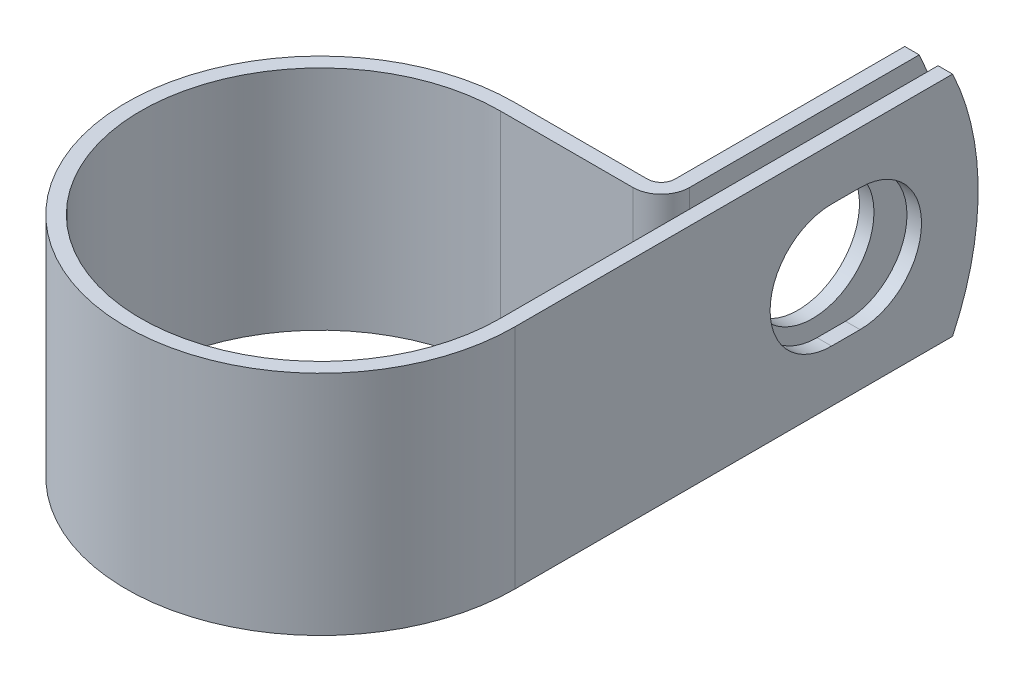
ISO-10303-21;
HEADER;
FILE_DESCRIPTION(('STEP AP214'),'2;1');
FILE_NAME('part.step','',(''),(''),'','','');
FILE_SCHEMA(('AUTOMOTIVE_DESIGN { 1 0 10303 214 1 1 1 1 }'));
ENDSEC;
DATA;
#1=APPLICATION_CONTEXT('core data for automotive mechanical design processes');
#2=APPLICATION_PROTOCOL_DEFINITION('international standard','automotive_design',2000,#1);
#3=PRODUCT_CONTEXT('',#1,'mechanical');
#4=PRODUCT('Part','Part','',(#3));
#5=PRODUCT_RELATED_PRODUCT_CATEGORY('part','',(#4));
#6=PRODUCT_DEFINITION_FORMATION('','',#4);
#7=PRODUCT_DEFINITION_CONTEXT('part definition',#1,'design');
#8=PRODUCT_DEFINITION('design','',#6,#7);
#9=PRODUCT_DEFINITION_SHAPE('','',#8);
#10=(LENGTH_UNIT() NAMED_UNIT(*) SI_UNIT(.MILLI.,.METRE.));
#11=(NAMED_UNIT(*) PLANE_ANGLE_UNIT() SI_UNIT($,.RADIAN.));
#12=(NAMED_UNIT(*) SI_UNIT($,.STERADIAN.) SOLID_ANGLE_UNIT());
#13=UNCERTAINTY_MEASURE_WITH_UNIT(LENGTH_MEASURE(1.E-05),#10,'distance_accuracy_value','');
#14=(GEOMETRIC_REPRESENTATION_CONTEXT(3) GLOBAL_UNCERTAINTY_ASSIGNED_CONTEXT((#13)) GLOBAL_UNIT_ASSIGNED_CONTEXT((#10,
#11,#12)) REPRESENTATION_CONTEXT('',''));
#15=CARTESIAN_POINT('',(0.,0.,0.));
#16=DIRECTION('',(0.,0.,1.));
#17=DIRECTION('',(1.,0.,0.));
#18=AXIS2_PLACEMENT_3D('',#15,#16,#17);
#19=CARTESIAN_POINT('',(15.0749,9.525,0.));
#20=DIRECTION('',(-1.,0.,0.));
#21=DIRECTION('',(0.,0.,1.));
#22=AXIS2_PLACEMENT_3D('',#19,#20,#21);
#23=PLANE('',#22);
#24=DIRECTION('',(0.,0.,-1.));
#25=VECTOR('',#24,1.);
#26=CARTESIAN_POINT('',(15.0749,-5.1562,-26.5683999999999));
#27=LINE('',#26,#25);
#28=CARTESIAN_POINT('',(15.0749,-5.1562,-26.5683999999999));
#29=VERTEX_POINT('',#28);
#30=CARTESIAN_POINT('',(15.0749,-5.1562,-28.9560000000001));
#31=VERTEX_POINT('',#30);
#32=EDGE_CURVE('E236',#29,#31,#27,.T.);
#33=ORIENTED_EDGE('',*,*,#32,.T.);
#34=CARTESIAN_POINT('',(15.0749,0.,-28.9559999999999));
#35=DIRECTION('',(-1.,0.,0.));
#36=DIRECTION('',(0.,0.,1.));
#37=AXIS2_PLACEMENT_3D('',#34,#35,#36);
#38=CIRCLE('',#37,5.1562);
#39=CARTESIAN_POINT('',(15.0749,5.1562,-28.9560000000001));
#40=VERTEX_POINT('',#39);
#41=EDGE_CURVE('E257',#31,#40,#38,.F.);
#42=ORIENTED_EDGE('',*,*,#41,.T.);
#43=DIRECTION('',(0.,0.,1.));
#44=VECTOR('',#43,1.);
#45=CARTESIAN_POINT('',(15.0749,5.1562,-26.5683999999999));
#46=LINE('',#45,#44);
#47=CARTESIAN_POINT('',(15.0749,5.1562,-26.5683999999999));
#48=VERTEX_POINT('',#47);
#49=EDGE_CURVE('E253',#40,#48,#46,.T.);
#50=ORIENTED_EDGE('',*,*,#49,.T.);
#51=CARTESIAN_POINT('',(15.0749,0.,-26.5683999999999));
#52=DIRECTION('',(-1.,0.,0.));
#53=DIRECTION('',(0.,0.,1.));
#54=AXIS2_PLACEMENT_3D('',#51,#52,#53);
#55=CIRCLE('',#54,5.1562);
#56=EDGE_CURVE('E248',#48,#29,#55,.F.);
#57=ORIENTED_EDGE('',*,*,#56,.T.);
#58=EDGE_LOOP('',(#33,#42,#50,#57));
#59=FACE_BOUND('',#58,.T.);
#60=CARTESIAN_POINT('',(15.0749,0.,-16.637));
#61=DIRECTION('',(-1.,0.,0.));
#62=DIRECTION('',(0.,0.,1.));
#63=AXIS2_PLACEMENT_3D('',#60,#61,#62);
#64=CIRCLE('',#63,22.225);
#65=CARTESIAN_POINT('',(15.0749,9.525,-36.7174631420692));
#66=VERTEX_POINT('',#65);
#67=CARTESIAN_POINT('',(15.0749,-9.525,-36.7174631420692));
#68=VERTEX_POINT('',#67);
#69=EDGE_CURVE('E75',#66,#68,#64,.T.);
#70=ORIENTED_EDGE('',*,*,#69,.T.);
#71=DIRECTION('',(0.,0.,-1.));
#72=VECTOR('',#71,1.);
#73=CARTESIAN_POINT('',(15.0749,-9.525,0.));
#74=LINE('',#73,#72);
#75=CARTESIAN_POINT('',(15.0749,-9.525,0.));
#76=VERTEX_POINT('',#75);
#77=EDGE_CURVE('E271',#76,#68,#74,.T.);
#78=ORIENTED_EDGE('',*,*,#77,.F.);
#79=DIRECTION('',(0.,-1.,0.));
#80=VECTOR('',#79,1.);
#81=CARTESIAN_POINT('',(15.0749,9.525,0.));
#82=LINE('',#81,#80);
#83=CARTESIAN_POINT('',(15.0749,9.525,0.));
#84=VERTEX_POINT('',#83);
#85=EDGE_CURVE('E218',#84,#76,#82,.T.);
#86=ORIENTED_EDGE('',*,*,#85,.F.);
#87=DIRECTION('',(0.,0.,-1.));
#88=VECTOR('',#87,1.);
#89=CARTESIAN_POINT('',(15.0749,9.525,-15.0749));
#90=LINE('',#89,#88);
#91=EDGE_CURVE('E273',#84,#66,#90,.T.);
#92=ORIENTED_EDGE('',*,*,#91,.T.);
#93=EDGE_LOOP('',(#70,#78,#86,#92));
#94=FACE_BOUND('',#93,.T.);
#95=ADVANCED_FACE('F54',(#59,#94),#23,.T.);
#96=CARTESIAN_POINT('',(13.5001,9.525,-38.862));
#97=DIRECTION('',(1.,0.,0.));
#98=DIRECTION('',(0.,0.,-1.));
#99=AXIS2_PLACEMENT_3D('',#96,#97,#98);
#100=PLANE('',#99);
#101=CARTESIAN_POINT('',(13.5001,0.,-27.7622));
#102=DIRECTION('',(1.,0.,0.));
#103=DIRECTION('',(0.,0.,-1.));
#104=AXIS2_PLACEMENT_3D('',#101,#102,#103);
#105=CIRCLE('',#104,5.1562);
#106=CARTESIAN_POINT('',(13.5001,0.,-32.9184));
#107=VERTEX_POINT('',#106);
#108=EDGE_CURVE('E268',#107,#107,#105,.F.);
#109=ORIENTED_EDGE('',*,*,#108,.T.);
#110=EDGE_LOOP('',(#109));
#111=FACE_BOUND('',#110,.T.);
#112=DIRECTION('',(0.,0.,1.));
#113=VECTOR('',#112,1.);
#114=CARTESIAN_POINT('',(13.5001,-9.525,-38.862));
#115=LINE('',#114,#113);
#116=CARTESIAN_POINT('',(13.5001,-9.525,-36.7174631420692));
#117=VERTEX_POINT('',#116);
#118=CARTESIAN_POINT('',(13.5001,-9.525,-17.45234));
#119=VERTEX_POINT('',#118);
#120=EDGE_CURVE('E184',#117,#119,#115,.T.);
#121=ORIENTED_EDGE('',*,*,#120,.F.);
#122=CARTESIAN_POINT('',(13.5001,0.,-16.637));
#123=DIRECTION('',(1.,0.,0.));
#124=DIRECTION('',(0.,0.,-1.));
#125=AXIS2_PLACEMENT_3D('',#122,#123,#124);
#126=CIRCLE('',#125,22.225);
#127=CARTESIAN_POINT('',(13.5001,9.525,-36.7174631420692));
#128=VERTEX_POINT('',#127);
#129=EDGE_CURVE('E176',#117,#128,#126,.T.);
#130=ORIENTED_EDGE('',*,*,#129,.T.);
#131=DIRECTION('',(0.,0.,1.));
#132=VECTOR('',#131,1.);
#133=CARTESIAN_POINT('',(13.5001,9.525,-38.862));
#134=LINE('',#133,#132);
#135=CARTESIAN_POINT('',(13.5001,9.525,-17.45234));
#136=VERTEX_POINT('',#135);
#137=EDGE_CURVE('E224',#128,#136,#134,.T.);
#138=ORIENTED_EDGE('',*,*,#137,.T.);
#139=DIRECTION('',(0.,-1.,0.));
#140=VECTOR('',#139,1.);
#141=CARTESIAN_POINT('',(13.5001,9.525,-17.45234));
#142=LINE('',#141,#140);
#143=EDGE_CURVE('E211',#136,#119,#142,.T.);
#144=ORIENTED_EDGE('',*,*,#143,.T.);
#145=EDGE_LOOP('',(#121,#130,#138,#144));
#146=FACE_BOUND('',#145,.T.);
#147=ADVANCED_FACE('F226',(#111,#146),#100,.T.);
#148=CARTESIAN_POINT('',(12.2809,9.525,-38.862));
#149=DIRECTION('',(1.,0.,0.));
#150=DIRECTION('',(0.,0.,-1.));
#151=AXIS2_PLACEMENT_3D('',#148,#149,#150);
#152=PLANE('',#151);
#153=CARTESIAN_POINT('',(12.2809,0.,-27.7622));
#154=DIRECTION('',(-1.,0.,0.));
#155=DIRECTION('',(0.,0.,1.));
#156=AXIS2_PLACEMENT_3D('',#153,#154,#155);
#157=CIRCLE('',#156,5.1562);
#158=CARTESIAN_POINT('',(12.2809,0.,-22.606));
#159=VERTEX_POINT('',#158);
#160=EDGE_CURVE('E265',#159,#159,#157,.T.);
#161=ORIENTED_EDGE('',*,*,#160,.F.);
#162=EDGE_LOOP('',(#161));
#163=FACE_BOUND('',#162,.T.);
#164=CARTESIAN_POINT('',(12.2809,0.,-16.637));
#165=DIRECTION('',(-1.,0.,0.));
#166=DIRECTION('',(0.,0.,1.));
#167=AXIS2_PLACEMENT_3D('',#164,#165,#166);
#168=CIRCLE('',#167,22.225);
#169=CARTESIAN_POINT('',(12.2809,9.525,-36.7174631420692));
#170=VERTEX_POINT('',#169);
#171=CARTESIAN_POINT('',(12.2809,-9.525,-36.7174631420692));
#172=VERTEX_POINT('',#171);
#173=EDGE_CURVE('E67',#170,#172,#168,.T.);
#174=ORIENTED_EDGE('',*,*,#173,.T.);
#175=DIRECTION('',(0.,0.,1.));
#176=VECTOR('',#175,1.);
#177=CARTESIAN_POINT('',(12.2809,-9.525,-38.862));
#178=LINE('',#177,#176);
#179=CARTESIAN_POINT('',(12.2809,-9.525,-17.45234));
#180=VERTEX_POINT('',#179);
#181=EDGE_CURVE('E167',#172,#180,#178,.T.);
#182=ORIENTED_EDGE('',*,*,#181,.T.);
#183=DIRECTION('',(0.,-1.,0.));
#184=VECTOR('',#183,1.);
#185=CARTESIAN_POINT('',(12.2809,9.525,-17.45234));
#186=LINE('',#185,#184);
#187=CARTESIAN_POINT('',(12.2809,9.525,-17.45234));
#188=VERTEX_POINT('',#187);
#189=EDGE_CURVE('E209',#188,#180,#186,.T.);
#190=ORIENTED_EDGE('',*,*,#189,.F.);
#191=DIRECTION('',(0.,0.,1.));
#192=VECTOR('',#191,1.);
#193=CARTESIAN_POINT('',(12.2809,9.525,-38.862));
#194=LINE('',#193,#192);
#195=EDGE_CURVE('E169',#170,#188,#194,.T.);
#196=ORIENTED_EDGE('',*,*,#195,.F.);
#197=EDGE_LOOP('',(#174,#182,#190,#196));
#198=FACE_BOUND('',#197,.T.);
#199=ADVANCED_FACE('F164',(#163,#198),#152,.F.);
#200=CARTESIAN_POINT('',(16.2941,9.525,0.));
#201=DIRECTION('',(-1.,0.,0.));
#202=DIRECTION('',(0.,0.,1.));
#203=AXIS2_PLACEMENT_3D('',#200,#201,#202);
#204=PLANE('',#203);
#205=CARTESIAN_POINT('',(16.2941,0.,-28.9559999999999));
#206=DIRECTION('',(1.,0.,0.));
#207=DIRECTION('',(0.,0.,-1.));
#208=AXIS2_PLACEMENT_3D('',#205,#206,#207);
#209=CIRCLE('',#208,5.1562);
#210=CARTESIAN_POINT('',(16.2941,-5.1562,-28.9560000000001));
#211=VERTEX_POINT('',#210);
#212=CARTESIAN_POINT('',(16.2941,5.1562,-28.9560000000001));
#213=VERTEX_POINT('',#212);
#214=EDGE_CURVE('E237',#211,#213,#209,.T.);
#215=ORIENTED_EDGE('',*,*,#214,.F.);
#216=DIRECTION('',(0.,0.,-1.));
#217=VECTOR('',#216,1.);
#218=CARTESIAN_POINT('',(16.2941,-5.1562,-26.5683999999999));
#219=LINE('',#218,#217);
#220=CARTESIAN_POINT('',(16.2941,-5.1562,-26.5683999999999));
#221=VERTEX_POINT('',#220);
#222=EDGE_CURVE('E240',#221,#211,#219,.T.);
#223=ORIENTED_EDGE('',*,*,#222,.F.);
#224=CARTESIAN_POINT('',(16.2941,0.,-26.5683999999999));
#225=DIRECTION('',(1.,0.,0.));
#226=DIRECTION('',(0.,0.,-1.));
#227=AXIS2_PLACEMENT_3D('',#224,#225,#226);
#228=CIRCLE('',#227,5.1562);
#229=CARTESIAN_POINT('',(16.2941,5.1562,-26.5683999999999));
#230=VERTEX_POINT('',#229);
#231=EDGE_CURVE('E230',#230,#221,#228,.T.);
#232=ORIENTED_EDGE('',*,*,#231,.F.);
#233=DIRECTION('',(0.,0.,1.));
#234=VECTOR('',#233,1.);
#235=CARTESIAN_POINT('',(16.2941,5.1562,-26.5683999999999));
#236=LINE('',#235,#234);
#237=EDGE_CURVE('E234',#213,#230,#236,.T.);
#238=ORIENTED_EDGE('',*,*,#237,.F.);
#239=EDGE_LOOP('',(#215,#223,#232,#238));
#240=FACE_BOUND('',#239,.T.);
#241=DIRECTION('',(0.,0.,-1.));
#242=VECTOR('',#241,1.);
#243=CARTESIAN_POINT('',(16.2941,-9.525,0.));
#244=LINE('',#243,#242);
#245=CARTESIAN_POINT('',(16.2941,-9.525,0.));
#246=VERTEX_POINT('',#245);
#247=CARTESIAN_POINT('',(16.2941,-9.525,-36.7174631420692));
#248=VERTEX_POINT('',#247);
#249=EDGE_CURVE('E195',#246,#248,#244,.T.);
#250=ORIENTED_EDGE('',*,*,#249,.T.);
#251=CARTESIAN_POINT('',(16.2941,0.,-16.637));
#252=DIRECTION('',(-1.,0.,0.));
#253=DIRECTION('',(0.,0.,1.));
#254=AXIS2_PLACEMENT_3D('',#251,#252,#253);
#255=CIRCLE('',#254,22.225);
#256=CARTESIAN_POINT('',(16.2941,9.525,-36.7174631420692));
#257=VERTEX_POINT('',#256);
#258=EDGE_CURVE('E170',#257,#248,#255,.T.);
#259=ORIENTED_EDGE('',*,*,#258,.F.);
#260=DIRECTION('',(0.,0.,-1.));
#261=VECTOR('',#260,1.);
#262=CARTESIAN_POINT('',(16.2941,9.525,-15.0749));
#263=LINE('',#262,#261);
#264=CARTESIAN_POINT('',(16.2941,9.525,0.));
#265=VERTEX_POINT('',#264);
#266=EDGE_CURVE('E198',#265,#257,#263,.T.);
#267=ORIENTED_EDGE('',*,*,#266,.F.);
#268=DIRECTION('',(0.,-1.,0.));
#269=VECTOR('',#268,1.);
#270=CARTESIAN_POINT('',(16.2941,9.525,0.));
#271=LINE('',#270,#269);
#272=EDGE_CURVE('E199',#265,#246,#271,.T.);
#273=ORIENTED_EDGE('',*,*,#272,.T.);
#274=EDGE_LOOP('',(#250,#259,#267,#273));
#275=FACE_BOUND('',#274,.T.);
#276=ADVANCED_FACE('F321',(#240,#275),#204,.F.);
#277=CARTESIAN_POINT('',(0.,-9.525,0.));
#278=DIRECTION('',(0.,1.,0.));
#279=DIRECTION('',(1.,0.,0.));
#280=AXIS2_PLACEMENT_3D('',#277,#278,#279);
#281=PLANE('',#280);
#282=DIRECTION('',(-1.,0.,0.));
#283=VECTOR('',#282,1.);
#284=CARTESIAN_POINT('',(16.2941,-9.525,-36.7174631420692));
#285=LINE('',#284,#283);
#286=EDGE_CURVE('E171',#248,#68,#285,.T.);
#287=ORIENTED_EDGE('',*,*,#286,.F.);
#288=ORIENTED_EDGE('',*,*,#249,.F.);
#289=CARTESIAN_POINT('',(0.,-9.525,0.));
#290=DIRECTION('',(0.,1.,0.));
#291=DIRECTION('',(1.,0.,0.));
#292=AXIS2_PLACEMENT_3D('',#289,#290,#291);
#293=CIRCLE('',#292,16.2941);
#294=CARTESIAN_POINT('',(0.,-9.525,-16.2941));
#295=VERTEX_POINT('',#294);
#296=EDGE_CURVE('E193',#295,#246,#293,.T.);
#297=ORIENTED_EDGE('',*,*,#296,.F.);
#298=DIRECTION('',(-1.,0.,0.));
#299=VECTOR('',#298,1.);
#300=CARTESIAN_POINT('',(0.,-9.525,-16.2941));
#301=LINE('',#300,#299);
#302=CARTESIAN_POINT('',(11.12266,-9.525,-16.2941));
#303=VERTEX_POINT('',#302);
#304=EDGE_CURVE('E186',#303,#295,#301,.T.);
#305=ORIENTED_EDGE('',*,*,#304,.F.);
#306=CARTESIAN_POINT('',(11.12266,-9.525,-17.45234));
#307=DIRECTION('',(0.,1.,0.));
#308=DIRECTION('',(1.,0.,0.));
#309=AXIS2_PLACEMENT_3D('',#306,#307,#308);
#310=CIRCLE('',#309,1.15824);
#311=EDGE_CURVE('E183',#180,#303,#310,.F.);
#312=ORIENTED_EDGE('',*,*,#311,.F.);
#313=ORIENTED_EDGE('',*,*,#181,.F.);
#314=DIRECTION('',(-1.,0.,0.));
#315=VECTOR('',#314,1.);
#316=CARTESIAN_POINT('',(16.2941,-9.525,-36.7174631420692));
#317=LINE('',#316,#315);
#318=EDGE_CURVE('E12',#117,#172,#317,.T.);
#319=ORIENTED_EDGE('',*,*,#318,.F.);
#320=ORIENTED_EDGE('',*,*,#120,.T.);
#321=CARTESIAN_POINT('',(11.12266,-9.525,-17.45234));
#322=DIRECTION('',(0.,-1.,0.));
#323=DIRECTION('',(0.,0.,1.));
#324=AXIS2_PLACEMENT_3D('',#321,#322,#323);
#325=CIRCLE('',#324,2.37744);
#326=CARTESIAN_POINT('',(11.12266,-9.525,-15.0749));
#327=VERTEX_POINT('',#326);
#328=EDGE_CURVE('E188',#119,#327,#325,.T.);
#329=ORIENTED_EDGE('',*,*,#328,.T.);
#330=DIRECTION('',(-1.,0.,0.));
#331=VECTOR('',#330,1.);
#332=CARTESIAN_POINT('',(0.,-9.525,-15.0749));
#333=LINE('',#332,#331);
#334=CARTESIAN_POINT('',(0.,-9.525,-15.0749));
#335=VERTEX_POINT('',#334);
#336=EDGE_CURVE('E298',#327,#335,#333,.T.);
#337=ORIENTED_EDGE('',*,*,#336,.T.);
#338=CARTESIAN_POINT('',(0.,-9.525,0.));
#339=DIRECTION('',(0.,1.,0.));
#340=DIRECTION('',(0.,0.,1.));
#341=AXIS2_PLACEMENT_3D('',#338,#339,#340);
#342=CIRCLE('',#341,15.0749);
#343=EDGE_CURVE('E295',#335,#76,#342,.T.);
#344=ORIENTED_EDGE('',*,*,#343,.T.);
#345=ORIENTED_EDGE('',*,*,#77,.T.);
#346=EDGE_LOOP('',(#287,#288,#297,#305,#312,#313,#319,#320,#329,#337,#344,#345));
#347=FACE_BOUND('',#346,.T.);
#348=ADVANCED_FACE('F181',(#347),#281,.F.);
#349=CARTESIAN_POINT('',(0.,9.525,0.));
#350=DIRECTION('',(0.,1.,0.));
#351=DIRECTION('',(1.,0.,0.));
#352=AXIS2_PLACEMENT_3D('',#349,#350,#351);
#353=PLANE('',#352);
#354=ORIENTED_EDGE('',*,*,#266,.T.);
#355=DIRECTION('',(-1.,0.,0.));
#356=VECTOR('',#355,1.);
#357=CARTESIAN_POINT('',(16.2941,9.525,-36.7174631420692));
#358=LINE('',#357,#356);
#359=EDGE_CURVE('E228',#257,#66,#358,.T.);
#360=ORIENTED_EDGE('',*,*,#359,.T.);
#361=ORIENTED_EDGE('',*,*,#91,.F.);
#362=CARTESIAN_POINT('',(0.,9.525,0.));
#363=DIRECTION('',(0.,1.,0.));
#364=DIRECTION('',(0.,0.,1.));
#365=AXIS2_PLACEMENT_3D('',#362,#363,#364);
#366=CIRCLE('',#365,15.0749);
#367=CARTESIAN_POINT('',(0.,9.525,-15.0749));
#368=VERTEX_POINT('',#367);
#369=EDGE_CURVE('E276',#368,#84,#366,.T.);
#370=ORIENTED_EDGE('',*,*,#369,.F.);
#371=DIRECTION('',(-1.,0.,0.));
#372=VECTOR('',#371,1.);
#373=CARTESIAN_POINT('',(0.,9.525,-15.0749));
#374=LINE('',#373,#372);
#375=CARTESIAN_POINT('',(11.12266,9.525,-15.0749));
#376=VERTEX_POINT('',#375);
#377=EDGE_CURVE('E279',#376,#368,#374,.T.);
#378=ORIENTED_EDGE('',*,*,#377,.F.);
#379=CARTESIAN_POINT('',(11.12266,9.525,-17.45234));
#380=DIRECTION('',(0.,-1.,0.));
#381=DIRECTION('',(0.,0.,1.));
#382=AXIS2_PLACEMENT_3D('',#379,#380,#381);
#383=CIRCLE('',#382,2.37744);
#384=EDGE_CURVE('E282',#136,#376,#383,.T.);
#385=ORIENTED_EDGE('',*,*,#384,.F.);
#386=ORIENTED_EDGE('',*,*,#137,.F.);
#387=DIRECTION('',(-1.,0.,0.));
#388=VECTOR('',#387,1.);
#389=CARTESIAN_POINT('',(16.2941,9.525,-36.7174631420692));
#390=LINE('',#389,#388);
#391=EDGE_CURVE('E61',#128,#170,#390,.T.);
#392=ORIENTED_EDGE('',*,*,#391,.T.);
#393=ORIENTED_EDGE('',*,*,#195,.T.);
#394=CARTESIAN_POINT('',(11.12266,9.525,-17.45234));
#395=DIRECTION('',(0.,1.,0.));
#396=DIRECTION('',(1.,0.,0.));
#397=AXIS2_PLACEMENT_3D('',#394,#395,#396);
#398=CIRCLE('',#397,1.15824);
#399=CARTESIAN_POINT('',(11.12266,9.525,-16.2941));
#400=VERTEX_POINT('',#399);
#401=EDGE_CURVE('E287',#188,#400,#398,.F.);
#402=ORIENTED_EDGE('',*,*,#401,.T.);
#403=DIRECTION('',(-1.,0.,0.));
#404=VECTOR('',#403,1.);
#405=CARTESIAN_POINT('',(0.,9.525,-16.2941));
#406=LINE('',#405,#404);
#407=CARTESIAN_POINT('',(0.,9.525,-16.2941));
#408=VERTEX_POINT('',#407);
#409=EDGE_CURVE('E289',#400,#408,#406,.T.);
#410=ORIENTED_EDGE('',*,*,#409,.T.);
#411=CARTESIAN_POINT('',(0.,9.525,0.));
#412=DIRECTION('',(0.,1.,0.));
#413=DIRECTION('',(1.,0.,0.));
#414=AXIS2_PLACEMENT_3D('',#411,#412,#413);
#415=CIRCLE('',#414,16.2941);
#416=EDGE_CURVE('E203',#408,#265,#415,.T.);
#417=ORIENTED_EDGE('',*,*,#416,.T.);
#418=EDGE_LOOP('',(#354,#360,#361,#370,#378,#385,#386,#392,#393,#402,#410,#417));
#419=FACE_BOUND('',#418,.T.);
#420=ADVANCED_FACE('F222',(#419),#353,.T.);
#421=CARTESIAN_POINT('',(0.,9.525,0.));
#422=DIRECTION('',(0.,-1.,0.));
#423=DIRECTION('',(0.,0.,-1.));
#424=AXIS2_PLACEMENT_3D('',#421,#422,#423);
#425=CYLINDRICAL_SURFACE('',#424,15.0749);
#426=ORIENTED_EDGE('',*,*,#343,.F.);
#427=DIRECTION('',(0.,-1.,0.));
#428=VECTOR('',#427,1.);
#429=CARTESIAN_POINT('',(0.,9.525,-15.0749));
#430=LINE('',#429,#428);
#431=EDGE_CURVE('E216',#368,#335,#430,.T.);
#432=ORIENTED_EDGE('',*,*,#431,.F.);
#433=ORIENTED_EDGE('',*,*,#369,.T.);
#434=ORIENTED_EDGE('',*,*,#85,.T.);
#435=EDGE_LOOP('',(#426,#432,#433,#434));
#436=FACE_BOUND('',#435,.T.);
#437=ADVANCED_FACE('F311',(#436),#425,.F.);
#438=CARTESIAN_POINT('',(0.,9.525,-15.0749));
#439=DIRECTION('',(0.,0.,1.));
#440=DIRECTION('',(1.,0.,0.));
#441=AXIS2_PLACEMENT_3D('',#438,#439,#440);
#442=PLANE('',#441);
#443=ORIENTED_EDGE('',*,*,#336,.F.);
#444=DIRECTION('',(0.,-1.,0.));
#445=VECTOR('',#444,1.);
#446=CARTESIAN_POINT('',(11.12266,9.525,-15.0749));
#447=LINE('',#446,#445);
#448=EDGE_CURVE('E214',#376,#327,#447,.T.);
#449=ORIENTED_EDGE('',*,*,#448,.F.);
#450=ORIENTED_EDGE('',*,*,#377,.T.);
#451=ORIENTED_EDGE('',*,*,#431,.T.);
#452=EDGE_LOOP('',(#443,#449,#450,#451));
#453=FACE_BOUND('',#452,.T.);
#454=ADVANCED_FACE('F307',(#453),#442,.T.);
#455=CARTESIAN_POINT('',(11.12266,9.525,-17.45234));
#456=DIRECTION('',(0.,-1.,0.));
#457=DIRECTION('',(0.,0.,-1.));
#458=AXIS2_PLACEMENT_3D('',#455,#456,#457);
#459=CYLINDRICAL_SURFACE('',#458,2.37744);
#460=ORIENTED_EDGE('',*,*,#328,.F.);
#461=ORIENTED_EDGE('',*,*,#143,.F.);
#462=ORIENTED_EDGE('',*,*,#384,.T.);
#463=ORIENTED_EDGE('',*,*,#448,.T.);
#464=EDGE_LOOP('',(#460,#461,#462,#463));
#465=FACE_BOUND('',#464,.T.);
#466=ADVANCED_FACE('F304',(#465),#459,.T.);
#467=CARTESIAN_POINT('',(11.12266,9.525,-17.45234));
#468=DIRECTION('',(0.,-1.,0.));
#469=DIRECTION('',(0.,0.,-1.));
#470=AXIS2_PLACEMENT_3D('',#467,#468,#469);
#471=CYLINDRICAL_SURFACE('',#470,1.15824);
#472=ORIENTED_EDGE('',*,*,#311,.T.);
#473=DIRECTION('',(0.,-1.,0.));
#474=VECTOR('',#473,1.);
#475=CARTESIAN_POINT('',(11.12266,9.525,-16.2941));
#476=LINE('',#475,#474);
#477=EDGE_CURVE('E206',#400,#303,#476,.T.);
#478=ORIENTED_EDGE('',*,*,#477,.F.);
#479=ORIENTED_EDGE('',*,*,#401,.F.);
#480=ORIENTED_EDGE('',*,*,#189,.T.);
#481=EDGE_LOOP('',(#472,#478,#479,#480));
#482=FACE_BOUND('',#481,.T.);
#483=ADVANCED_FACE('F334',(#482),#471,.F.);
#484=CARTESIAN_POINT('',(0.,9.525,-16.2941));
#485=DIRECTION('',(0.,0.,1.));
#486=DIRECTION('',(1.,0.,0.));
#487=AXIS2_PLACEMENT_3D('',#484,#485,#486);
#488=PLANE('',#487);
#489=ORIENTED_EDGE('',*,*,#304,.T.);
#490=DIRECTION('',(0.,-1.,0.));
#491=VECTOR('',#490,1.);
#492=CARTESIAN_POINT('',(0.,9.525,-16.2941));
#493=LINE('',#492,#491);
#494=EDGE_CURVE('E202',#408,#295,#493,.T.);
#495=ORIENTED_EDGE('',*,*,#494,.F.);
#496=ORIENTED_EDGE('',*,*,#409,.F.);
#497=ORIENTED_EDGE('',*,*,#477,.T.);
#498=EDGE_LOOP('',(#489,#495,#496,#497));
#499=FACE_BOUND('',#498,.T.);
#500=ADVANCED_FACE('F330',(#499),#488,.F.);
#501=CARTESIAN_POINT('',(0.,9.525,0.));
#502=DIRECTION('',(0.,-1.,0.));
#503=DIRECTION('',(0.,0.,-1.));
#504=AXIS2_PLACEMENT_3D('',#501,#502,#503);
#505=CYLINDRICAL_SURFACE('',#504,16.2941);
#506=ORIENTED_EDGE('',*,*,#296,.T.);
#507=ORIENTED_EDGE('',*,*,#272,.F.);
#508=ORIENTED_EDGE('',*,*,#416,.F.);
#509=ORIENTED_EDGE('',*,*,#494,.T.);
#510=EDGE_LOOP('',(#506,#507,#508,#509));
#511=FACE_BOUND('',#510,.T.);
#512=ADVANCED_FACE('F327',(#511),#505,.T.);
#513=CARTESIAN_POINT('',(28.0840359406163,0.,-27.7622));
#514=DIRECTION('',(-1.,0.,0.));
#515=DIRECTION('',(0.,0.,1.));
#516=AXIS2_PLACEMENT_3D('',#513,#514,#515);
#517=CYLINDRICAL_SURFACE('',#516,5.1562);
#518=ORIENTED_EDGE('',*,*,#160,.T.);
#519=EDGE_LOOP('',(#518));
#520=FACE_BOUND('',#519,.T.);
#521=ORIENTED_EDGE('',*,*,#108,.F.);
#522=EDGE_LOOP('',(#521));
#523=FACE_BOUND('',#522,.T.);
#524=ADVANCED_FACE('F379',(#520,#523),#517,.F.);
#525=CARTESIAN_POINT('',(-1.28467193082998,-5.1562,-26.5683999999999));
#526=DIRECTION('',(0.,-1.,0.));
#527=DIRECTION('',(0.,0.,-1.));
#528=AXIS2_PLACEMENT_3D('',#525,#526,#527);
#529=PLANE('',#528);
#530=DIRECTION('',(1.,0.,0.));
#531=VECTOR('',#530,1.);
#532=CARTESIAN_POINT('',(-1.28467193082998,-5.1562,-26.5683999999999));
#533=LINE('',#532,#531);
#534=EDGE_CURVE('E251',#29,#221,#533,.T.);
#535=ORIENTED_EDGE('',*,*,#534,.T.);
#536=ORIENTED_EDGE('',*,*,#222,.T.);
#537=DIRECTION('',(1.,0.,0.));
#538=VECTOR('',#537,1.);
#539=CARTESIAN_POINT('',(-1.28467193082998,-5.1562,-28.9560000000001));
#540=LINE('',#539,#538);
#541=EDGE_CURVE('E247',#31,#211,#540,.T.);
#542=ORIENTED_EDGE('',*,*,#541,.F.);
#543=ORIENTED_EDGE('',*,*,#32,.F.);
#544=EDGE_LOOP('',(#535,#536,#542,#543));
#545=FACE_BOUND('',#544,.T.);
#546=ADVANCED_FACE('F354',(#545),#529,.F.);
#547=CARTESIAN_POINT('',(-1.28467193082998,0.,-28.9559999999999));
#548=DIRECTION('',(1.,0.,0.));
#549=DIRECTION('',(0.,0.,-1.));
#550=AXIS2_PLACEMENT_3D('',#547,#548,#549);
#551=CYLINDRICAL_SURFACE('',#550,5.1562);
#552=ORIENTED_EDGE('',*,*,#541,.T.);
#553=ORIENTED_EDGE('',*,*,#214,.T.);
#554=DIRECTION('',(1.,0.,0.));
#555=VECTOR('',#554,1.);
#556=CARTESIAN_POINT('',(-1.28467193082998,5.1562,-28.9560000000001));
#557=LINE('',#556,#555);
#558=EDGE_CURVE('E256',#40,#213,#557,.T.);
#559=ORIENTED_EDGE('',*,*,#558,.F.);
#560=ORIENTED_EDGE('',*,*,#41,.F.);
#561=EDGE_LOOP('',(#552,#553,#559,#560));
#562=FACE_BOUND('',#561,.T.);
#563=ADVANCED_FACE('F358',(#562),#551,.F.);
#564=CARTESIAN_POINT('',(-1.28467193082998,5.1562,-26.5683999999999));
#565=DIRECTION('',(0.,1.,0.));
#566=DIRECTION('',(0.,0.,1.));
#567=AXIS2_PLACEMENT_3D('',#564,#565,#566);
#568=PLANE('',#567);
#569=ORIENTED_EDGE('',*,*,#558,.T.);
#570=ORIENTED_EDGE('',*,*,#237,.T.);
#571=DIRECTION('',(1.,0.,0.));
#572=VECTOR('',#571,1.);
#573=CARTESIAN_POINT('',(-1.28467193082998,5.1562,-26.5683999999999));
#574=LINE('',#573,#572);
#575=EDGE_CURVE('E252',#48,#230,#574,.T.);
#576=ORIENTED_EDGE('',*,*,#575,.F.);
#577=ORIENTED_EDGE('',*,*,#49,.F.);
#578=EDGE_LOOP('',(#569,#570,#576,#577));
#579=FACE_BOUND('',#578,.T.);
#580=ADVANCED_FACE('F362',(#579),#568,.F.);
#581=CARTESIAN_POINT('',(-1.28467193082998,0.,-26.5683999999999));
#582=DIRECTION('',(1.,0.,0.));
#583=DIRECTION('',(0.,0.,-1.));
#584=AXIS2_PLACEMENT_3D('',#581,#582,#583);
#585=CYLINDRICAL_SURFACE('',#584,5.1562);
#586=ORIENTED_EDGE('',*,*,#575,.T.);
#587=ORIENTED_EDGE('',*,*,#231,.T.);
#588=ORIENTED_EDGE('',*,*,#534,.F.);
#589=ORIENTED_EDGE('',*,*,#56,.F.);
#590=EDGE_LOOP('',(#586,#587,#588,#589));
#591=FACE_BOUND('',#590,.T.);
#592=ADVANCED_FACE('F366',(#591),#585,.F.);
#593=CARTESIAN_POINT('',(16.2941,0.,-16.637));
#594=DIRECTION('',(-1.,0.,0.));
#595=DIRECTION('',(0.,0.,1.));
#596=AXIS2_PLACEMENT_3D('',#593,#594,#595);
#597=CYLINDRICAL_SURFACE('',#596,22.225);
#598=ORIENTED_EDGE('',*,*,#129,.F.);
#599=ORIENTED_EDGE('',*,*,#318,.T.);
#600=ORIENTED_EDGE('',*,*,#173,.F.);
#601=ORIENTED_EDGE('',*,*,#391,.F.);
#602=EDGE_LOOP('',(#598,#599,#600,#601));
#603=FACE_BOUND('',#602,.T.);
#604=ADVANCED_FACE('F174',(#603),#597,.T.);
#605=ORIENTED_EDGE('',*,*,#359,.F.);
#606=ORIENTED_EDGE('',*,*,#258,.T.);
#607=ORIENTED_EDGE('',*,*,#286,.T.);
#608=ORIENTED_EDGE('',*,*,#69,.F.);
#609=EDGE_LOOP('',(#605,#606,#607,#608));
#610=FACE_BOUND('',#609,.T.);
#611=ADVANCED_FACE('F316',(#610),#597,.T.);
#612=CLOSED_SHELL('',(#95,#147,#199,#276,#348,#420,#437,#454,#466,#483,#500,#512,#524,#546,#563,
#580,#592,#604,#611));
#613=MANIFOLD_SOLID_BREP('B2',#612);
#614=ADVANCED_BREP_SHAPE_REPRESENTATION('',(#18,#613),#14);
#615=SHAPE_DEFINITION_REPRESENTATION(#9,#614);
ENDSEC;
END-ISO-10303-21;
